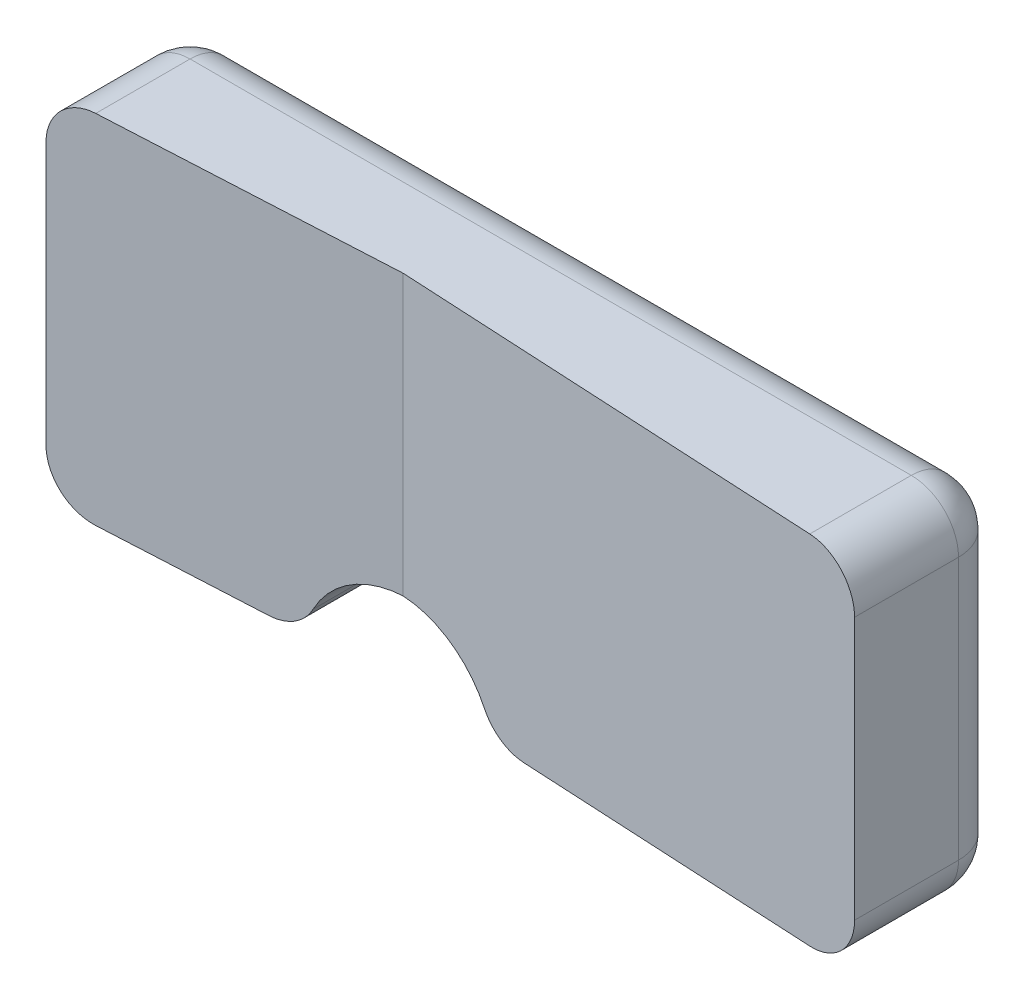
from build123d import *

# Parameters (mm, degrees)
EXTRUDE1_DEPTH      = 19.05
EXTRUDE1_DEPTH_BACK = 10
SKETCH1_W           = 137
SKETCH1_H           = 59.944
CUT_EXTRUDE2_DEPTH  = 108.458
CUT_EXTRUDE3_DEPTH  = 25.641058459
FILLET4_R           = 7.9375


with BuildPart() as part:
    # Sketch1 → Extrude1 (new, two sides: drawn at the far end of the back side and taken through both)
    with BuildSketch(Plane.XY.offset(-EXTRUDE1_DEPTH_BACK)):
        with Locations((11.5, -4.572)):
            Rectangle(SKETCH1_W, SKETCH1_H)
    extrude(amount=EXTRUDE1_DEPTH + EXTRUDE1_DEPTH_BACK)

    # Sketch2 → Cut-Extrude2 (cut)
    with BuildSketch(Plane(origin=(0, 25.4, 0), x_dir=(-1, 0, 0), z_dir=(0, 1, 0))):
        Polygon((-80, 15.4), (0, 11.207377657), (57, 14.194621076), (57, 40.752664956), (-80, 40.752664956), align=None)
    extrude(amount=-CUT_EXTRUDE2_DEPTH, mode=Mode.SUBTRACT)

    # Sketch3 → Cut-Extrude3 (cut)
    with BuildSketch(Plane(origin=(0, 0, -10), x_dir=(-1, 0, 0), z_dir=(0, 0, -1))):
        with BuildLine():
            Line((-15.875, -34.544), (15.875, -34.544))
            ThreePointArc((15.875, -34.544), (0, -21.544130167), (-15.875, -34.544))
        make_face()
    extrude(amount=-CUT_EXTRUDE3_DEPTH, mode=Mode.SUBTRACT)

    # Fillet4
    fillet4_edges = [part.edges().sort_by_distance(p)[0] for p in [
        (-57, -34.544, 2.097310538),
        (-36.4375, -34.544, -10),
        (-57, -4.572, -10),
        (-57, 25.4, 2.097310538),
        (11.5, 25.4, -10),
        (47.9375, -34.544, -10),
        (80, -34.544, 2.7),
        (80, -4.572, -10),
        (80, 25.4, 2.7),
        (-15.875, -34.544, 1.019675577),
        (0, -21.544130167, -10),
        (15.875, -34.544, 1.019675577),
    ]]
    fillet(fillet4_edges, radius=FILLET4_R)


solid = part.part
